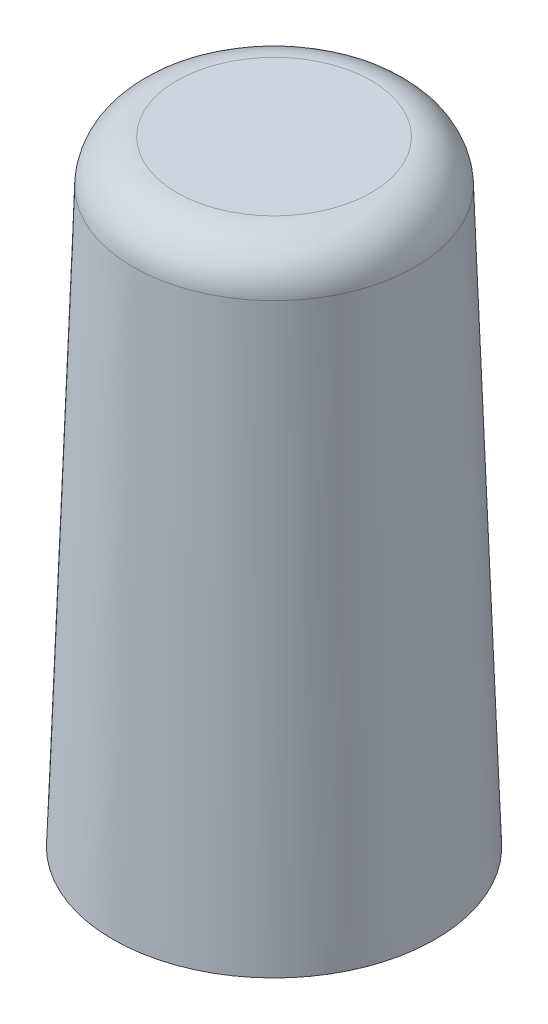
ISO-10303-21;
HEADER;
FILE_DESCRIPTION(('STEP AP214'),'2;1');
FILE_NAME('part.step','',(''),(''),'','','');
FILE_SCHEMA(('AUTOMOTIVE_DESIGN { 1 0 10303 214 1 1 1 1 }'));
ENDSEC;
DATA;
#1=APPLICATION_CONTEXT('core data for automotive mechanical design processes');
#2=APPLICATION_PROTOCOL_DEFINITION('international standard','automotive_design',2000,#1);
#3=PRODUCT_CONTEXT('',#1,'mechanical');
#4=PRODUCT('Part','Part','',(#3));
#5=PRODUCT_RELATED_PRODUCT_CATEGORY('part','',(#4));
#6=PRODUCT_DEFINITION_FORMATION('','',#4);
#7=PRODUCT_DEFINITION_CONTEXT('part definition',#1,'design');
#8=PRODUCT_DEFINITION('design','',#6,#7);
#9=PRODUCT_DEFINITION_SHAPE('','',#8);
#10=(LENGTH_UNIT() NAMED_UNIT(*) SI_UNIT(.MILLI.,.METRE.));
#11=(NAMED_UNIT(*) PLANE_ANGLE_UNIT() SI_UNIT($,.RADIAN.));
#12=(NAMED_UNIT(*) SI_UNIT($,.STERADIAN.) SOLID_ANGLE_UNIT());
#13=UNCERTAINTY_MEASURE_WITH_UNIT(LENGTH_MEASURE(1.E-05),#10,'distance_accuracy_value','');
#14=(GEOMETRIC_REPRESENTATION_CONTEXT(3) GLOBAL_UNCERTAINTY_ASSIGNED_CONTEXT((#13)) GLOBAL_UNIT_ASSIGNED_CONTEXT((#10,
#11,#12)) REPRESENTATION_CONTEXT('',''));
#15=CARTESIAN_POINT('',(0.,0.,0.));
#16=DIRECTION('',(0.,0.,1.));
#17=DIRECTION('',(1.,0.,0.));
#18=AXIS2_PLACEMENT_3D('',#15,#16,#17);
#19=CARTESIAN_POINT('',(0.,0.,0.));
#20=DIRECTION('',(0.,-1.,0.));
#21=DIRECTION('',(0.,0.,1.));
#22=AXIS2_PLACEMENT_3D('',#19,#20,#21);
#23=CONICAL_SURFACE('',#22,11.,0.0349065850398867);
#24=CARTESIAN_POINT('',(0.,39.1046984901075,0.));
#25=DIRECTION('',(0.,-1.,0.));
#26=DIRECTION('',(0.,0.,-1.));
#27=AXIS2_PLACEMENT_3D('',#24,#25,#26);
#28=CIRCLE('',#27,9.63443383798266);
#29=CARTESIAN_POINT('',(0.,39.1046984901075,-9.63443383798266));
#30=VERTEX_POINT('',#29);
#31=EDGE_CURVE('E10',#30,#30,#28,.T.);
#32=ORIENTED_EDGE('',*,*,#31,.T.);
#33=EDGE_LOOP('',(#32));
#34=FACE_BOUND('',#33,.T.);
#35=CARTESIAN_POINT('',(0.,0.,0.));
#36=DIRECTION('',(0.,1.,0.));
#37=DIRECTION('',(0.,0.,1.));
#38=AXIS2_PLACEMENT_3D('',#35,#36,#37);
#39=CIRCLE('',#38,11.);
#40=CARTESIAN_POINT('',(0.,0.,11.));
#41=VERTEX_POINT('',#40);
#42=EDGE_CURVE('E41',#41,#41,#39,.T.);
#43=ORIENTED_EDGE('',*,*,#42,.T.);
#44=EDGE_LOOP('',(#43));
#45=FACE_BOUND('',#44,.T.);
#46=ADVANCED_FACE('F30',(#34,#45),#23,.T.);
#47=CARTESIAN_POINT('',(0.,42.,0.));
#48=DIRECTION('',(0.,1.,0.));
#49=DIRECTION('',(0.,0.,1.));
#50=AXIS2_PLACEMENT_3D('',#47,#48,#49);
#51=PLANE('',#50);
#52=CARTESIAN_POINT('',(0.,42.,0.));
#53=DIRECTION('',(0.,1.,0.));
#54=DIRECTION('',(0.,0.,1.));
#55=AXIS2_PLACEMENT_3D('',#52,#53,#54);
#56=CIRCLE('',#55,6.63626135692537);
#57=CARTESIAN_POINT('',(0.,42.,6.63626135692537));
#58=VERTEX_POINT('',#57);
#59=EDGE_CURVE('E37',#58,#58,#56,.T.);
#60=ORIENTED_EDGE('',*,*,#59,.T.);
#61=EDGE_LOOP('',(#60));
#62=FACE_BOUND('',#61,.T.);
#63=ADVANCED_FACE('F51',(#62),#51,.T.);
#64=CARTESIAN_POINT('',(0.,0.,0.));
#65=DIRECTION('',(0.,1.,0.));
#66=DIRECTION('',(0.,0.,1.));
#67=AXIS2_PLACEMENT_3D('',#64,#65,#66);
#68=PLANE('',#67);
#69=ORIENTED_EDGE('',*,*,#42,.F.);
#70=EDGE_LOOP('',(#69));
#71=FACE_BOUND('',#70,.T.);
#72=ADVANCED_FACE('F49',(#71),#68,.F.);
#73=CARTESIAN_POINT('',(0.,39.,0.));
#74=DIRECTION('',(0.,1.,0.));
#75=DIRECTION('',(0.,0.,1.));
#76=AXIS2_PLACEMENT_3D('',#73,#74,#75);
#77=TOROIDAL_SURFACE('',#76,6.63626135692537,3.);
#78=ORIENTED_EDGE('',*,*,#31,.F.);
#79=EDGE_LOOP('',(#78));
#80=FACE_BOUND('',#79,.T.);
#81=ORIENTED_EDGE('',*,*,#59,.F.);
#82=EDGE_LOOP('',(#81));
#83=FACE_BOUND('',#82,.T.);
#84=ADVANCED_FACE('F32',(#80,#83),#77,.T.);
#85=CLOSED_SHELL('',(#46,#63,#72,#84));
#86=MANIFOLD_SOLID_BREP('B2',#85);
#87=ADVANCED_BREP_SHAPE_REPRESENTATION('',(#18,#86),#14);
#88=SHAPE_DEFINITION_REPRESENTATION(#9,#87);
ENDSEC;
END-ISO-10303-21;
